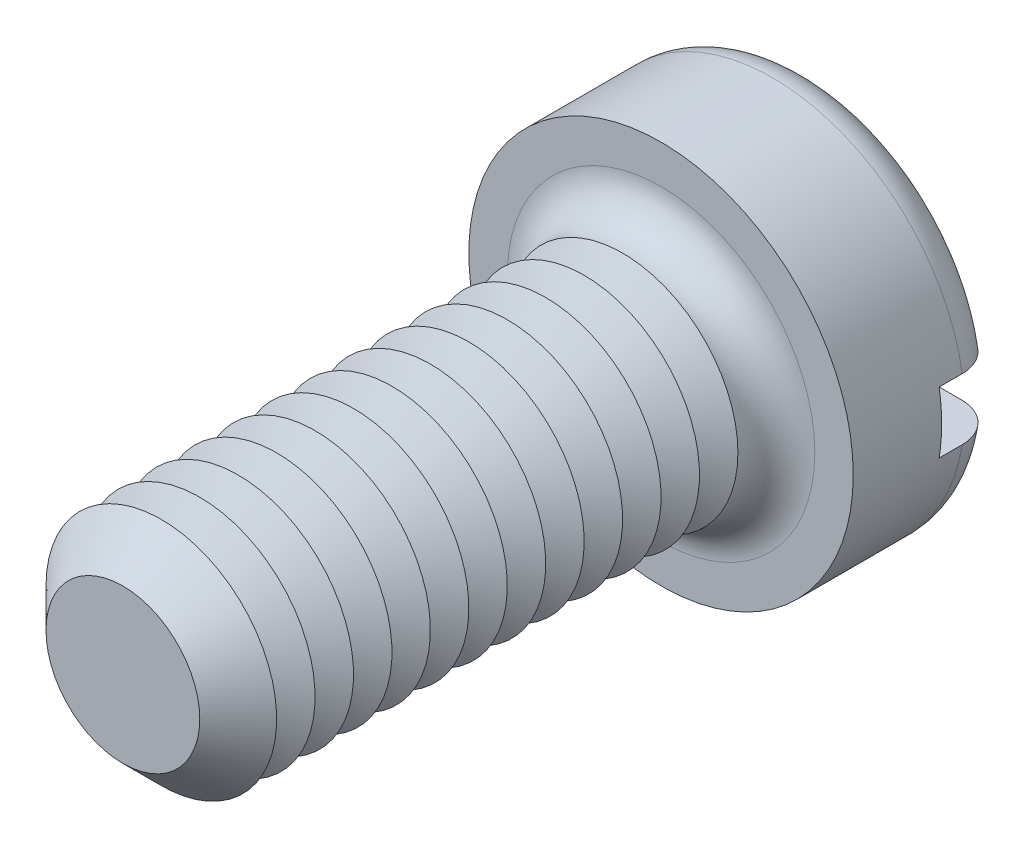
from build123d import *

# Parameters (mm, degrees)
SKETCH3_R           = 5
BOSS_EXTRUDE2_DEPTH = 3.9
SKETCH4_R           = 3
BOSS_EXTRUDE3_DEPTH = 14
FILLET1_R           = 1
CHAMFER1_SIZE       = 1
LPATTERN1_COUNT     = 12
LPATTERN1_PITCH     = 1
SKETCH8_W           = 10
SKETCH8_H           = 1.6
CUT_EXTRUDE1_DEPTH  = 1.6


with BuildPart() as part:
    # Sketch3 → Boss-Extrude2 (new body)
    with BuildSketch(Plane.XY):
        Circle(SKETCH3_R)
    extrude(amount=-BOSS_EXTRUDE2_DEPTH)

    # Sketch4 → Boss-Extrude3 (add)
    with BuildSketch(Plane.XY):
        Circle(SKETCH4_R)
    extrude(amount=BOSS_EXTRUDE3_DEPTH)

    # Fillet1
    fillet1_edges = [part.edges().sort_by_distance(p)[0] for p in [
        (-5, 0, -3.9),
        (-3, 0, 0),
    ]]
    fillet(fillet1_edges, radius=FILLET1_R)

    # Chamfer1
    chamfer1_edges = [part.edges().sort_by_distance(p)[0] for p in [
        (-3, 0, 14),
    ]]
    chamfer(chamfer1_edges, length=CHAMFER1_SIZE)

    # Sketch6 → Cut-Revolve1 (revolve, cut)
    with BuildSketch(Plane(origin=(0, 0, 0), x_dir=(0, 0, -1), z_dir=(1, 0, 0)), mode=Mode.PRIVATE) as cut_revolve1_sk:
        Polygon((-1, 3), (-1.5, 2.133974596), (-2, 3), align=None)
    cut_revolve1 = revolve(cut_revolve1_sk.sketch.rotate(Axis((0, 0, -1.694361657), (0, 0, 1)), 90), axis=Axis((0, 0, -1.694361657), (0, 0, 1)), mode=Mode.SUBTRACT)

    # LPattern1: Cut-Revolve1 ×12
    with Locations(*[(0, 0, i * LPATTERN1_PITCH) for i in range(1, LPATTERN1_COUNT)]):
        add(cut_revolve1, mode=Mode.SUBTRACT)

    # Sketch8 → Cut-Extrude1 (cut)
    with BuildSketch(Plane(origin=(0, 0, -3.9), x_dir=(-1, 0, 0), z_dir=(0, 0, -1))):
        Rectangle(SKETCH8_W, SKETCH8_H)
    extrude(amount=-CUT_EXTRUDE1_DEPTH, mode=Mode.SUBTRACT)


solid = part.part
